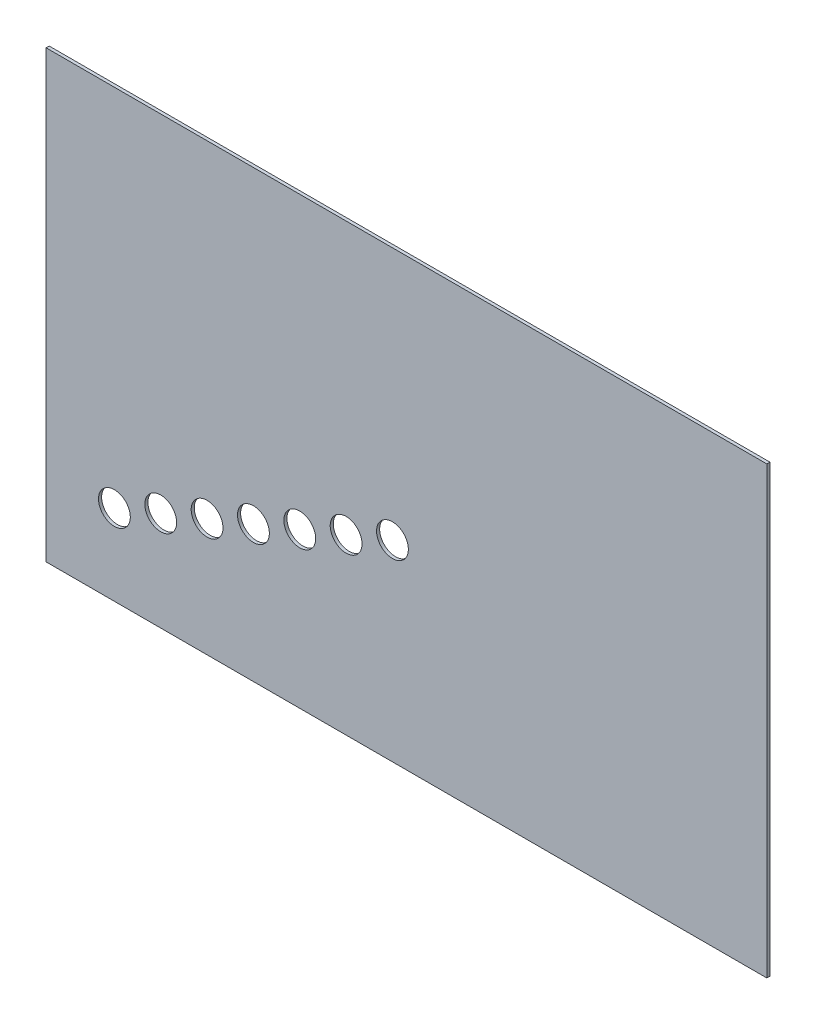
from build123d import *

# Parameters (mm, degrees)
SKIZZE1_W                       = 233.290943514
SKIZZE1_H                       = 144.116325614
AUFSATZ_LINEAR_AUSTRAGEN1_DEPTH = 1
SKIZZE2_R                       = 5.148196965
SCHNITT_LINEAR_AUSTRAGEN1_DEPTH = 138.11143245
LINEARES_MUSTER2_COUNT          = 7
LINEARES_MUSTER2_PITCH          = 16.155494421


with BuildPart() as part:
    # Skizze1 → Aufsatz-Linear austragen1 (new body)
    with BuildSketch(Plane.XY):
        Rectangle(SKIZZE1_W, SKIZZE1_H)
    extrude(amount=AUFSATZ_LINEAR_AUSTRAGEN1_DEPTH)

    # Skizze2 → Schnitt-Linear austragen1 (cut, through all)
    with BuildSketch(Plane.XY.offset(1)):
        with Locations((-94.532866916, -45.903367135)):
            Circle(SKIZZE2_R)
    schnitt_linear_austragen1 = extrude(amount=-SCHNITT_LINEAR_AUSTRAGEN1_DEPTH, mode=Mode.SUBTRACT)

    # Lineares Muster2: Schnitt-Linear austragen1 ×7
    with Locations(*[Vector(0.9284766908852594, 0.37139067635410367, 0) * (i * LINEARES_MUSTER2_PITCH) for i in range(1, LINEARES_MUSTER2_COUNT)]):
        add(schnitt_linear_austragen1, mode=Mode.SUBTRACT)


solid = part.part
